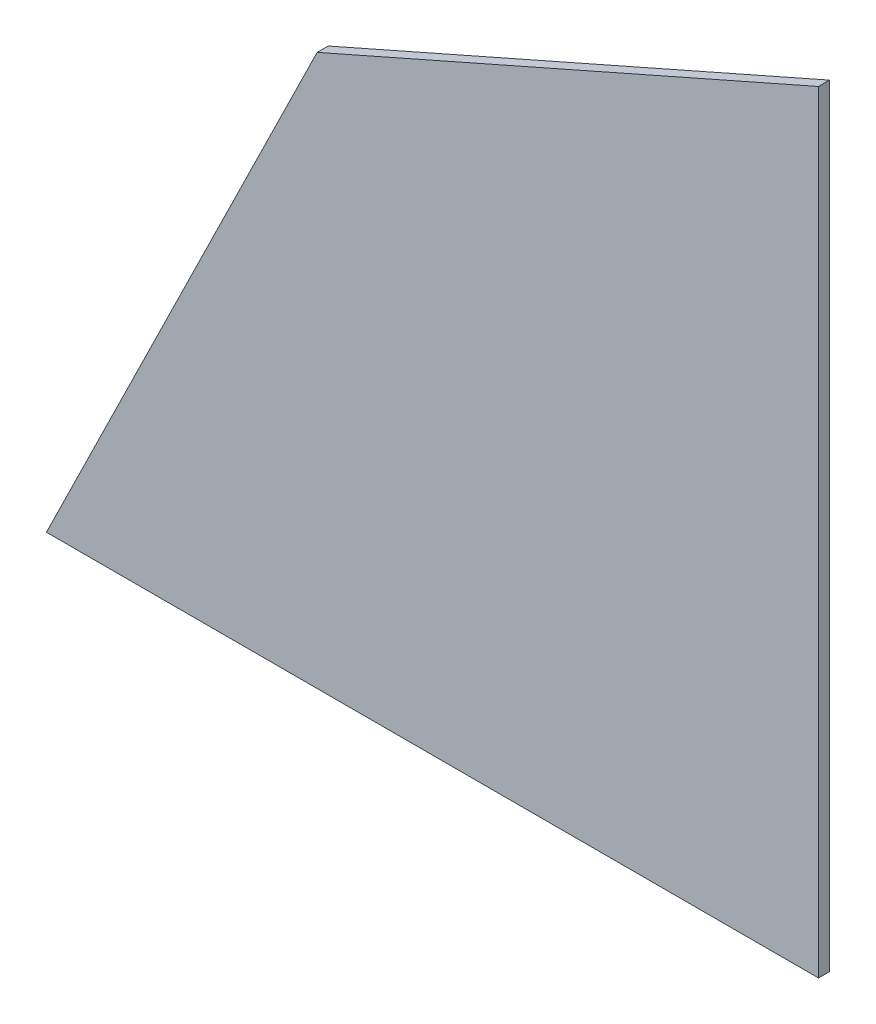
from build123d import *

# Parameters (mm, degrees)
ESPESSAMENTO1_T1 = 1


with BuildPart() as body_1:
    # Esbo_o1 → Superf_cie-Preenchimento1: a flat surface bounded by the sketch
    with BuildSketch(Plane.XY, mode=Mode.PRIVATE) as superf_cie_preenchimento1_1_region:
        Polygon((0, 0), (35, 0), (35, 70), (-10.455841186, 49.95), (-35, 0), align=None)
    superf_cie_preenchimento1_1 = superf_cie_preenchimento1_1_region.sketch.faces()[0]
    add(Solid.thicken(superf_cie_preenchimento1_1, ESPESSAMENTO1_T1))


solid = body_1.part
